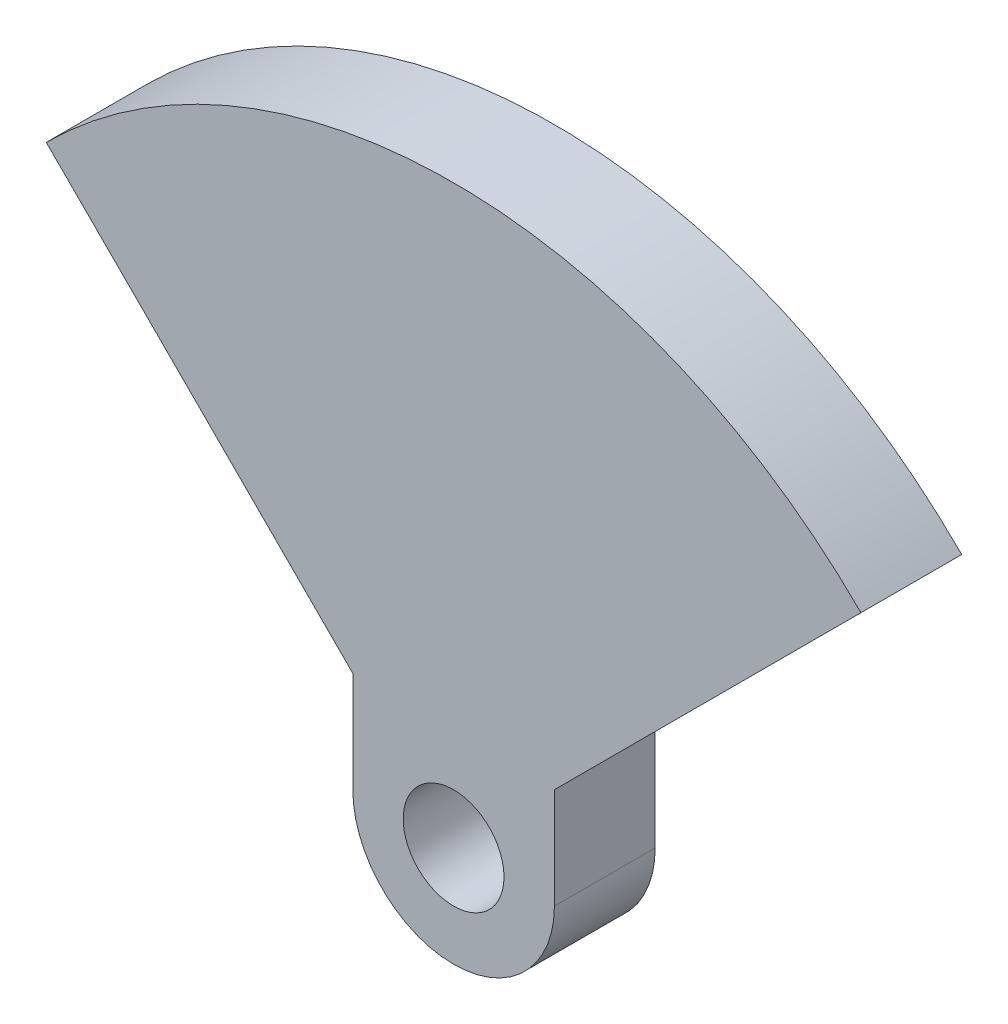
ISO-10303-21;
HEADER;
FILE_DESCRIPTION(('STEP AP214'),'2;1');
FILE_NAME('part.step','',(''),(''),'','','');
FILE_SCHEMA(('AUTOMOTIVE_DESIGN { 1 0 10303 214 1 1 1 1 }'));
ENDSEC;
DATA;
#1=APPLICATION_CONTEXT('core data for automotive mechanical design processes');
#2=APPLICATION_PROTOCOL_DEFINITION('international standard','automotive_design',2000,#1);
#3=PRODUCT_CONTEXT('',#1,'mechanical');
#4=PRODUCT('Part','Part','',(#3));
#5=PRODUCT_RELATED_PRODUCT_CATEGORY('part','',(#4));
#6=PRODUCT_DEFINITION_FORMATION('','',#4);
#7=PRODUCT_DEFINITION_CONTEXT('part definition',#1,'design');
#8=PRODUCT_DEFINITION('design','',#6,#7);
#9=PRODUCT_DEFINITION_SHAPE('','',#8);
#10=(LENGTH_UNIT() NAMED_UNIT(*) SI_UNIT(.MILLI.,.METRE.));
#11=(NAMED_UNIT(*) PLANE_ANGLE_UNIT() SI_UNIT($,.RADIAN.));
#12=(NAMED_UNIT(*) SI_UNIT($,.STERADIAN.) SOLID_ANGLE_UNIT());
#13=UNCERTAINTY_MEASURE_WITH_UNIT(LENGTH_MEASURE(1.E-05),#10,'distance_accuracy_value','');
#14=(GEOMETRIC_REPRESENTATION_CONTEXT(3) GLOBAL_UNCERTAINTY_ASSIGNED_CONTEXT((#13)) GLOBAL_UNIT_ASSIGNED_CONTEXT((#10,
#11,#12)) REPRESENTATION_CONTEXT('',''));
#15=CARTESIAN_POINT('',(0.,0.,0.));
#16=DIRECTION('',(0.,0.,1.));
#17=DIRECTION('',(1.,0.,0.));
#18=AXIS2_PLACEMENT_3D('',#15,#16,#17);
#19=CARTESIAN_POINT('',(-5.999999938,0.,5.999999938));
#20=DIRECTION('',(-1.,0.,0.));
#21=DIRECTION('',(0.,0.,1.));
#22=AXIS2_PLACEMENT_3D('',#19,#20,#21);
#23=PLANE('',#22);
#24=DIRECTION('',(0.,1.,0.));
#25=VECTOR('',#24,1.);
#26=CARTESIAN_POINT('',(-5.999999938,0.,0.));
#27=LINE('',#26,#25);
#28=CARTESIAN_POINT('',(-5.999999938,0.,0.));
#29=VERTEX_POINT('',#28);
#30=CARTESIAN_POINT('',(-5.999999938,5.99999993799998,0.));
#31=VERTEX_POINT('',#30);
#32=EDGE_CURVE('E137',#29,#31,#27,.T.);
#33=ORIENTED_EDGE('',*,*,#32,.F.);
#34=DIRECTION('',(0.,0.,-1.));
#35=VECTOR('',#34,1.);
#36=CARTESIAN_POINT('',(-5.999999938,0.,5.999999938));
#37=LINE('',#36,#35);
#38=CARTESIAN_POINT('',(-5.999999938,0.,5.999999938));
#39=VERTEX_POINT('',#38);
#40=EDGE_CURVE('E11',#39,#29,#37,.T.);
#41=ORIENTED_EDGE('',*,*,#40,.F.);
#42=DIRECTION('',(0.,1.,0.));
#43=VECTOR('',#42,1.);
#44=CARTESIAN_POINT('',(-5.999999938,0.,5.999999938));
#45=LINE('',#44,#43);
#46=CARTESIAN_POINT('',(-5.999999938,5.99999993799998,5.999999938));
#47=VERTEX_POINT('',#46);
#48=EDGE_CURVE('E183',#39,#47,#45,.T.);
#49=ORIENTED_EDGE('',*,*,#48,.T.);
#50=DIRECTION('',(0.,0.,-1.));
#51=VECTOR('',#50,1.);
#52=CARTESIAN_POINT('',(-5.999999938,5.99999993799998,5.999999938));
#53=LINE('',#52,#51);
#54=EDGE_CURVE('E60',#47,#31,#53,.T.);
#55=ORIENTED_EDGE('',*,*,#54,.T.);
#56=EDGE_LOOP('',(#33,#41,#49,#55));
#57=FACE_BOUND('',#56,.T.);
#58=ADVANCED_FACE('F43',(#57),#23,.T.);
#59=CARTESIAN_POINT('',(0.,0.,5.999999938));
#60=DIRECTION('',(0.,0.,-1.));
#61=DIRECTION('',(-1.,0.,0.));
#62=AXIS2_PLACEMENT_3D('',#59,#60,#61);
#63=CYLINDRICAL_SURFACE('',#62,5.999999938);
#64=CARTESIAN_POINT('',(0.,0.,0.));
#65=DIRECTION('',(0.,0.,1.));
#66=DIRECTION('',(1.,0.,0.));
#67=AXIS2_PLACEMENT_3D('',#64,#65,#66);
#68=CIRCLE('',#67,5.999999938);
#69=CARTESIAN_POINT('',(5.999999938,0.,0.));
#70=VERTEX_POINT('',#69);
#71=EDGE_CURVE('E134',#29,#70,#68,.T.);
#72=ORIENTED_EDGE('',*,*,#71,.T.);
#73=DIRECTION('',(0.,0.,-1.));
#74=VECTOR('',#73,1.);
#75=CARTESIAN_POINT('',(5.999999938,0.,5.999999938));
#76=LINE('',#75,#74);
#77=CARTESIAN_POINT('',(5.999999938,0.,5.999999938));
#78=VERTEX_POINT('',#77);
#79=EDGE_CURVE('E52',#78,#70,#76,.T.);
#80=ORIENTED_EDGE('',*,*,#79,.F.);
#81=CARTESIAN_POINT('',(0.,0.,5.999999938));
#82=DIRECTION('',(0.,0.,1.));
#83=DIRECTION('',(1.,0.,0.));
#84=AXIS2_PLACEMENT_3D('',#81,#82,#83);
#85=CIRCLE('',#84,5.999999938);
#86=EDGE_CURVE('E185',#39,#78,#85,.T.);
#87=ORIENTED_EDGE('',*,*,#86,.F.);
#88=ORIENTED_EDGE('',*,*,#40,.T.);
#89=EDGE_LOOP('',(#72,#80,#87,#88));
#90=FACE_BOUND('',#89,.T.);
#91=ADVANCED_FACE('F135',(#90),#63,.T.);
#92=CARTESIAN_POINT('',(5.999999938,0.,5.999999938));
#93=DIRECTION('',(-1.,0.,0.));
#94=DIRECTION('',(0.,0.,1.));
#95=AXIS2_PLACEMENT_3D('',#92,#93,#94);
#96=PLANE('',#95);
#97=DIRECTION('',(0.,1.,0.));
#98=VECTOR('',#97,1.);
#99=CARTESIAN_POINT('',(5.999999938,0.,0.));
#100=LINE('',#99,#98);
#101=CARTESIAN_POINT('',(5.999999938,5.99999993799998,0.));
#102=VERTEX_POINT('',#101);
#103=EDGE_CURVE('E131',#70,#102,#100,.T.);
#104=ORIENTED_EDGE('',*,*,#103,.T.);
#105=DIRECTION('',(0.,0.,-1.));
#106=VECTOR('',#105,1.);
#107=CARTESIAN_POINT('',(5.999999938,5.99999993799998,5.999999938));
#108=LINE('',#107,#106);
#109=CARTESIAN_POINT('',(5.999999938,5.99999993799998,5.999999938));
#110=VERTEX_POINT('',#109);
#111=EDGE_CURVE('E120',#110,#102,#108,.T.);
#112=ORIENTED_EDGE('',*,*,#111,.F.);
#113=DIRECTION('',(0.,1.,0.));
#114=VECTOR('',#113,1.);
#115=CARTESIAN_POINT('',(5.999999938,0.,5.999999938));
#116=LINE('',#115,#114);
#117=EDGE_CURVE('E113',#78,#110,#116,.T.);
#118=ORIENTED_EDGE('',*,*,#117,.F.);
#119=ORIENTED_EDGE('',*,*,#79,.T.);
#120=EDGE_LOOP('',(#104,#112,#118,#119));
#121=FACE_BOUND('',#120,.T.);
#122=ADVANCED_FACE('F130',(#121),#96,.F.);
#123=CARTESIAN_POINT('',(0.,0.,5.999999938));
#124=DIRECTION('',(-0.707106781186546,0.707106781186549,0.));
#125=DIRECTION('',(-0.707106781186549,-0.707106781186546,0.));
#126=AXIS2_PLACEMENT_3D('',#123,#124,#125);
#127=PLANE('',#126);
#128=DIRECTION('',(0.707106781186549,0.707106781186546,0.));
#129=VECTOR('',#128,1.);
#130=CARTESIAN_POINT('',(0.,0.,0.));
#131=LINE('',#130,#129);
#132=CARTESIAN_POINT('',(24.2466915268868,24.2466915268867,0.));
#133=VERTEX_POINT('',#132);
#134=EDGE_CURVE('E119',#102,#133,#131,.T.);
#135=ORIENTED_EDGE('',*,*,#134,.T.);
#136=DIRECTION('',(0.,0.,-1.));
#137=VECTOR('',#136,1.);
#138=CARTESIAN_POINT('',(24.2466915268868,24.2466915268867,5.999999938));
#139=LINE('',#138,#137);
#140=CARTESIAN_POINT('',(24.2466915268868,24.2466915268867,5.999999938));
#141=VERTEX_POINT('',#140);
#142=EDGE_CURVE('E102',#141,#133,#139,.T.);
#143=ORIENTED_EDGE('',*,*,#142,.F.);
#144=DIRECTION('',(0.707106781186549,0.707106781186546,0.));
#145=VECTOR('',#144,1.);
#146=CARTESIAN_POINT('',(0.,0.,5.999999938));
#147=LINE('',#146,#145);
#148=EDGE_CURVE('E107',#110,#141,#147,.T.);
#149=ORIENTED_EDGE('',*,*,#148,.F.);
#150=ORIENTED_EDGE('',*,*,#111,.T.);
#151=EDGE_LOOP('',(#135,#143,#149,#150));
#152=FACE_BOUND('',#151,.T.);
#153=ADVANCED_FACE('F118',(#152),#127,.F.);
#154=CARTESIAN_POINT('',(0.,0.,5.999999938));
#155=DIRECTION('',(0.,0.,-1.));
#156=DIRECTION('',(-1.,0.,0.));
#157=AXIS2_PLACEMENT_3D('',#154,#155,#156);
#158=CYLINDRICAL_SURFACE('',#157,34.29);
#159=CARTESIAN_POINT('',(0.,0.,0.));
#160=DIRECTION('',(0.,0.,1.));
#161=DIRECTION('',(1.,0.,0.));
#162=AXIS2_PLACEMENT_3D('',#159,#160,#161);
#163=CIRCLE('',#162,34.29);
#164=CARTESIAN_POINT('',(-24.2466915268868,24.2466915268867,0.));
#165=VERTEX_POINT('',#164);
#166=EDGE_CURVE('E145',#133,#165,#163,.T.);
#167=ORIENTED_EDGE('',*,*,#166,.T.);
#168=DIRECTION('',(0.,0.,-1.));
#169=VECTOR('',#168,1.);
#170=CARTESIAN_POINT('',(-24.2466915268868,24.2466915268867,5.999999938));
#171=LINE('',#170,#169);
#172=CARTESIAN_POINT('',(-24.2466915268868,24.2466915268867,5.999999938));
#173=VERTEX_POINT('',#172);
#174=EDGE_CURVE('E80',#173,#165,#171,.T.);
#175=ORIENTED_EDGE('',*,*,#174,.F.);
#176=CARTESIAN_POINT('',(0.,0.,5.999999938));
#177=DIRECTION('',(0.,0.,1.));
#178=DIRECTION('',(1.,0.,0.));
#179=AXIS2_PLACEMENT_3D('',#176,#177,#178);
#180=CIRCLE('',#179,34.29);
#181=EDGE_CURVE('E98',#141,#173,#180,.T.);
#182=ORIENTED_EDGE('',*,*,#181,.F.);
#183=ORIENTED_EDGE('',*,*,#142,.T.);
#184=EDGE_LOOP('',(#167,#175,#182,#183));
#185=FACE_BOUND('',#184,.T.);
#186=ADVANCED_FACE('F100',(#185),#158,.T.);
#187=CARTESIAN_POINT('',(0.,0.,5.999999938));
#188=DIRECTION('',(0.,0.,-1.));
#189=DIRECTION('',(-1.,0.,0.));
#190=AXIS2_PLACEMENT_3D('',#187,#188,#189);
#191=CYLINDRICAL_SURFACE('',#190,2.999999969);
#192=CARTESIAN_POINT('',(0.,0.,5.999999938));
#193=DIRECTION('',(0.,0.,1.));
#194=DIRECTION('',(1.,0.,0.));
#195=AXIS2_PLACEMENT_3D('',#192,#193,#194);
#196=CIRCLE('',#195,2.999999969);
#197=CARTESIAN_POINT('',(2.999999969,0.,5.999999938));
#198=VERTEX_POINT('',#197);
#199=EDGE_CURVE('E149',#198,#198,#196,.T.);
#200=ORIENTED_EDGE('',*,*,#199,.T.);
#201=EDGE_LOOP('',(#200));
#202=FACE_BOUND('',#201,.T.);
#203=CARTESIAN_POINT('',(0.,0.,0.));
#204=DIRECTION('',(0.,0.,1.));
#205=DIRECTION('',(1.,0.,0.));
#206=AXIS2_PLACEMENT_3D('',#203,#204,#205);
#207=CIRCLE('',#206,2.999999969);
#208=CARTESIAN_POINT('',(2.999999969,0.,0.));
#209=VERTEX_POINT('',#208);
#210=EDGE_CURVE('E140',#209,#209,#207,.T.);
#211=ORIENTED_EDGE('',*,*,#210,.F.);
#212=EDGE_LOOP('',(#211));
#213=FACE_BOUND('',#212,.T.);
#214=ADVANCED_FACE('F45',(#202,#213),#191,.F.);
#215=CARTESIAN_POINT('',(0.,0.,5.999999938));
#216=DIRECTION('',(-0.707106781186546,-0.707106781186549,0.));
#217=DIRECTION('',(0.707106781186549,-0.707106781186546,0.));
#218=AXIS2_PLACEMENT_3D('',#215,#216,#217);
#219=PLANE('',#218);
#220=DIRECTION('',(-0.707106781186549,0.707106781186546,0.));
#221=VECTOR('',#220,1.);
#222=CARTESIAN_POINT('',(0.,0.,0.));
#223=LINE('',#222,#221);
#224=EDGE_CURVE('E147',#31,#165,#223,.T.);
#225=ORIENTED_EDGE('',*,*,#224,.F.);
#226=ORIENTED_EDGE('',*,*,#54,.F.);
#227=DIRECTION('',(-0.707106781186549,0.707106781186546,0.));
#228=VECTOR('',#227,1.);
#229=CARTESIAN_POINT('',(0.,0.,5.999999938));
#230=LINE('',#229,#228);
#231=EDGE_CURVE('E106',#47,#173,#230,.T.);
#232=ORIENTED_EDGE('',*,*,#231,.T.);
#233=ORIENTED_EDGE('',*,*,#174,.T.);
#234=EDGE_LOOP('',(#225,#226,#232,#233));
#235=FACE_BOUND('',#234,.T.);
#236=ADVANCED_FACE('F157',(#235),#219,.T.);
#237=CARTESIAN_POINT('',(0.,0.,5.999999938));
#238=DIRECTION('',(0.,0.,1.));
#239=DIRECTION('',(1.,0.,0.));
#240=AXIS2_PLACEMENT_3D('',#237,#238,#239);
#241=PLANE('',#240);
#242=ORIENTED_EDGE('',*,*,#199,.F.);
#243=EDGE_LOOP('',(#242));
#244=FACE_BOUND('',#243,.T.);
#245=ORIENTED_EDGE('',*,*,#48,.F.);
#246=ORIENTED_EDGE('',*,*,#86,.T.);
#247=ORIENTED_EDGE('',*,*,#117,.T.);
#248=ORIENTED_EDGE('',*,*,#148,.T.);
#249=ORIENTED_EDGE('',*,*,#181,.T.);
#250=ORIENTED_EDGE('',*,*,#231,.F.);
#251=EDGE_LOOP('',(#245,#246,#247,#248,#249,#250));
#252=FACE_BOUND('',#251,.T.);
#253=ADVANCED_FACE('F111',(#244,#252),#241,.T.);
#254=CARTESIAN_POINT('',(0.,0.,0.));
#255=DIRECTION('',(0.,0.,1.));
#256=DIRECTION('',(1.,0.,0.));
#257=AXIS2_PLACEMENT_3D('',#254,#255,#256);
#258=PLANE('',#257);
#259=ORIENTED_EDGE('',*,*,#210,.T.);
#260=EDGE_LOOP('',(#259));
#261=FACE_BOUND('',#260,.T.);
#262=ORIENTED_EDGE('',*,*,#32,.T.);
#263=ORIENTED_EDGE('',*,*,#224,.T.);
#264=ORIENTED_EDGE('',*,*,#166,.F.);
#265=ORIENTED_EDGE('',*,*,#134,.F.);
#266=ORIENTED_EDGE('',*,*,#103,.F.);
#267=ORIENTED_EDGE('',*,*,#71,.F.);
#268=EDGE_LOOP('',(#262,#263,#264,#265,#266,#267));
#269=FACE_BOUND('',#268,.T.);
#270=ADVANCED_FACE('F154',(#261,#269),#258,.F.);
#271=CLOSED_SHELL('',(#58,#91,#122,#153,#186,#214,#236,#253,#270));
#272=MANIFOLD_SOLID_BREP('B2',#271);
#273=ADVANCED_BREP_SHAPE_REPRESENTATION('',(#18,#272),#14);
#274=SHAPE_DEFINITION_REPRESENTATION(#9,#273);
ENDSEC;
END-ISO-10303-21;
